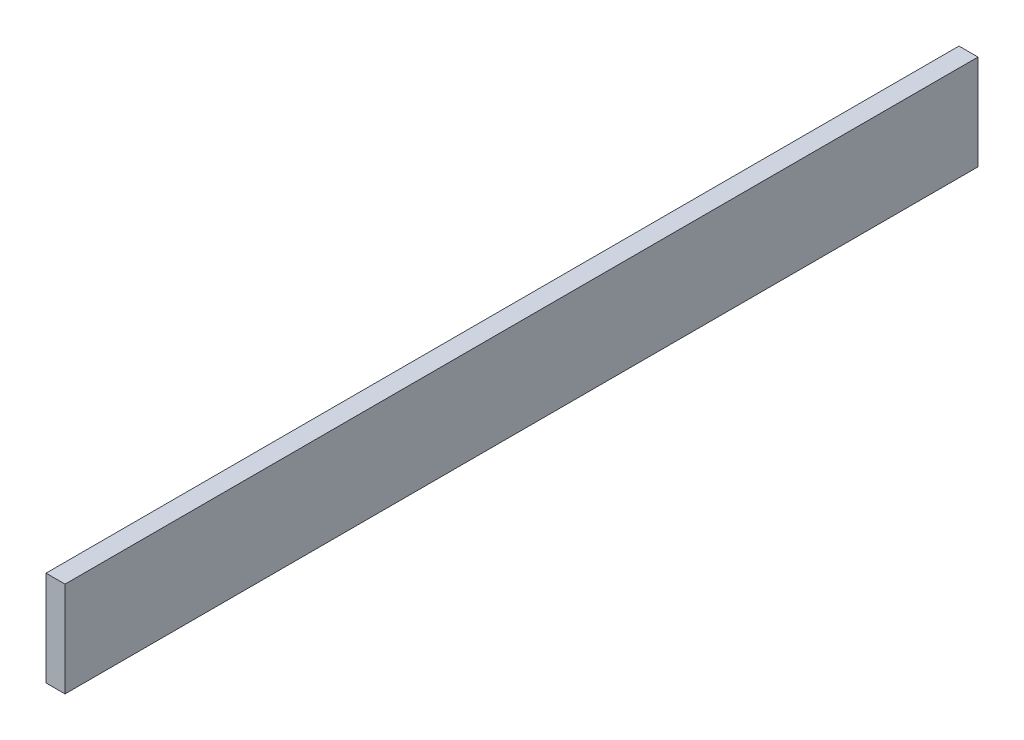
ISO-10303-21;
HEADER;
FILE_DESCRIPTION(('STEP AP214'),'2;1');
FILE_NAME('part.step','',(''),(''),'','','');
FILE_SCHEMA(('AUTOMOTIVE_DESIGN { 1 0 10303 214 1 1 1 1 }'));
ENDSEC;
DATA;
#1=APPLICATION_CONTEXT('core data for automotive mechanical design processes');
#2=APPLICATION_PROTOCOL_DEFINITION('international standard','automotive_design',2000,#1);
#3=PRODUCT_CONTEXT('',#1,'mechanical');
#4=PRODUCT('Part','Part','',(#3));
#5=PRODUCT_RELATED_PRODUCT_CATEGORY('part','',(#4));
#6=PRODUCT_DEFINITION_FORMATION('','',#4);
#7=PRODUCT_DEFINITION_CONTEXT('part definition',#1,'design');
#8=PRODUCT_DEFINITION('design','',#6,#7);
#9=PRODUCT_DEFINITION_SHAPE('','',#8);
#10=(LENGTH_UNIT() NAMED_UNIT(*) SI_UNIT(.MILLI.,.METRE.));
#11=(NAMED_UNIT(*) PLANE_ANGLE_UNIT() SI_UNIT($,.RADIAN.));
#12=(NAMED_UNIT(*) SI_UNIT($,.STERADIAN.) SOLID_ANGLE_UNIT());
#13=UNCERTAINTY_MEASURE_WITH_UNIT(LENGTH_MEASURE(1.E-05),#10,'distance_accuracy_value','');
#14=(GEOMETRIC_REPRESENTATION_CONTEXT(3) GLOBAL_UNCERTAINTY_ASSIGNED_CONTEXT((#13)) GLOBAL_UNIT_ASSIGNED_CONTEXT((#10,
#11,#12)) REPRESENTATION_CONTEXT('',''));
#15=CARTESIAN_POINT('',(0.,0.,0.));
#16=DIRECTION('',(0.,0.,1.));
#17=DIRECTION('',(1.,0.,0.));
#18=AXIS2_PLACEMENT_3D('',#15,#16,#17);
#19=CARTESIAN_POINT('',(0.,0.,-480.));
#20=DIRECTION('',(-1.,0.,0.));
#21=DIRECTION('',(0.,0.,1.));
#22=AXIS2_PLACEMENT_3D('',#19,#20,#21);
#23=PLANE('',#22);
#24=DIRECTION('',(0.,-1.,0.));
#25=VECTOR('',#24,1.);
#26=CARTESIAN_POINT('',(0.,0.,0.));
#27=LINE('',#26,#25);
#28=CARTESIAN_POINT('',(0.,50.,0.));
#29=VERTEX_POINT('',#28);
#30=CARTESIAN_POINT('',(0.,0.,0.));
#31=VERTEX_POINT('',#30);
#32=EDGE_CURVE('E96',#29,#31,#27,.T.);
#33=ORIENTED_EDGE('',*,*,#32,.F.);
#34=DIRECTION('',(0.,0.,1.));
#35=VECTOR('',#34,1.);
#36=CARTESIAN_POINT('',(0.,50.,-480.));
#37=LINE('',#36,#35);
#38=CARTESIAN_POINT('',(0.,50.,-480.));
#39=VERTEX_POINT('',#38);
#40=EDGE_CURVE('E11',#39,#29,#37,.T.);
#41=ORIENTED_EDGE('',*,*,#40,.F.);
#42=DIRECTION('',(0.,-1.,0.));
#43=VECTOR('',#42,1.);
#44=CARTESIAN_POINT('',(0.,0.,-480.));
#45=LINE('',#44,#43);
#46=CARTESIAN_POINT('',(0.,0.,-480.));
#47=VERTEX_POINT('',#46);
#48=EDGE_CURVE('E90',#39,#47,#45,.T.);
#49=ORIENTED_EDGE('',*,*,#48,.T.);
#50=DIRECTION('',(0.,0.,1.));
#51=VECTOR('',#50,1.);
#52=CARTESIAN_POINT('',(0.,0.,-480.));
#53=LINE('',#52,#51);
#54=EDGE_CURVE('E35',#47,#31,#53,.T.);
#55=ORIENTED_EDGE('',*,*,#54,.T.);
#56=EDGE_LOOP('',(#33,#41,#49,#55));
#57=FACE_BOUND('',#56,.T.);
#58=ADVANCED_FACE('F32',(#57),#23,.T.);
#59=CARTESIAN_POINT('',(0.,50.,-480.));
#60=DIRECTION('',(0.,1.,0.));
#61=DIRECTION('',(0.,0.,1.));
#62=AXIS2_PLACEMENT_3D('',#59,#60,#61);
#63=PLANE('',#62);
#64=DIRECTION('',(-1.,0.,0.));
#65=VECTOR('',#64,1.);
#66=CARTESIAN_POINT('',(0.,50.,0.));
#67=LINE('',#66,#65);
#68=CARTESIAN_POINT('',(10.,50.,0.));
#69=VERTEX_POINT('',#68);
#70=EDGE_CURVE('E92',#69,#29,#67,.T.);
#71=ORIENTED_EDGE('',*,*,#70,.F.);
#72=DIRECTION('',(0.,0.,1.));
#73=VECTOR('',#72,1.);
#74=CARTESIAN_POINT('',(10.,50.,-480.));
#75=LINE('',#74,#73);
#76=CARTESIAN_POINT('',(10.,50.,-480.));
#77=VERTEX_POINT('',#76);
#78=EDGE_CURVE('E41',#77,#69,#75,.T.);
#79=ORIENTED_EDGE('',*,*,#78,.F.);
#80=DIRECTION('',(-1.,0.,0.));
#81=VECTOR('',#80,1.);
#82=CARTESIAN_POINT('',(0.,50.,-480.));
#83=LINE('',#82,#81);
#84=EDGE_CURVE('E87',#77,#39,#83,.T.);
#85=ORIENTED_EDGE('',*,*,#84,.T.);
#86=ORIENTED_EDGE('',*,*,#40,.T.);
#87=EDGE_LOOP('',(#71,#79,#85,#86));
#88=FACE_BOUND('',#87,.T.);
#89=ADVANCED_FACE('F106',(#88),#63,.T.);
#90=CARTESIAN_POINT('',(10.,0.,-480.));
#91=DIRECTION('',(1.,0.,0.));
#92=DIRECTION('',(0.,0.,-1.));
#93=AXIS2_PLACEMENT_3D('',#90,#91,#92);
#94=PLANE('',#93);
#95=DIRECTION('',(0.,1.,0.));
#96=VECTOR('',#95,1.);
#97=CARTESIAN_POINT('',(10.,0.,0.));
#98=LINE('',#97,#96);
#99=CARTESIAN_POINT('',(10.,0.,0.));
#100=VERTEX_POINT('',#99);
#101=EDGE_CURVE('E82',#100,#69,#98,.T.);
#102=ORIENTED_EDGE('',*,*,#101,.F.);
#103=DIRECTION('',(0.,0.,1.));
#104=VECTOR('',#103,1.);
#105=CARTESIAN_POINT('',(10.,0.,-480.));
#106=LINE('',#105,#104);
#107=CARTESIAN_POINT('',(10.,0.,-480.));
#108=VERTEX_POINT('',#107);
#109=EDGE_CURVE('E77',#108,#100,#106,.T.);
#110=ORIENTED_EDGE('',*,*,#109,.F.);
#111=DIRECTION('',(0.,1.,0.));
#112=VECTOR('',#111,1.);
#113=CARTESIAN_POINT('',(10.,0.,-480.));
#114=LINE('',#113,#112);
#115=EDGE_CURVE('E80',#108,#77,#114,.T.);
#116=ORIENTED_EDGE('',*,*,#115,.T.);
#117=ORIENTED_EDGE('',*,*,#78,.T.);
#118=EDGE_LOOP('',(#102,#110,#116,#117));
#119=FACE_BOUND('',#118,.T.);
#120=ADVANCED_FACE('F79',(#119),#94,.T.);
#121=CARTESIAN_POINT('',(0.,0.,-480.));
#122=DIRECTION('',(0.,-1.,0.));
#123=DIRECTION('',(0.,0.,-1.));
#124=AXIS2_PLACEMENT_3D('',#121,#122,#123);
#125=PLANE('',#124);
#126=DIRECTION('',(1.,0.,0.));
#127=VECTOR('',#126,1.);
#128=CARTESIAN_POINT('',(0.,0.,0.));
#129=LINE('',#128,#127);
#130=EDGE_CURVE('E99',#31,#100,#129,.T.);
#131=ORIENTED_EDGE('',*,*,#130,.F.);
#132=ORIENTED_EDGE('',*,*,#54,.F.);
#133=DIRECTION('',(1.,0.,0.));
#134=VECTOR('',#133,1.);
#135=CARTESIAN_POINT('',(0.,0.,-480.));
#136=LINE('',#135,#134);
#137=EDGE_CURVE('E86',#47,#108,#136,.T.);
#138=ORIENTED_EDGE('',*,*,#137,.T.);
#139=ORIENTED_EDGE('',*,*,#109,.T.);
#140=EDGE_LOOP('',(#131,#132,#138,#139));
#141=FACE_BOUND('',#140,.T.);
#142=ADVANCED_FACE('F89',(#141),#125,.T.);
#143=CARTESIAN_POINT('',(0.,50.,-480.));
#144=DIRECTION('',(0.,0.,-1.));
#145=DIRECTION('',(-1.,0.,0.));
#146=AXIS2_PLACEMENT_3D('',#143,#144,#145);
#147=PLANE('',#146);
#148=ORIENTED_EDGE('',*,*,#48,.F.);
#149=ORIENTED_EDGE('',*,*,#84,.F.);
#150=ORIENTED_EDGE('',*,*,#115,.F.);
#151=ORIENTED_EDGE('',*,*,#137,.F.);
#152=EDGE_LOOP('',(#148,#149,#150,#151));
#153=FACE_BOUND('',#152,.T.);
#154=ADVANCED_FACE('F85',(#153),#147,.T.);
#155=CARTESIAN_POINT('',(0.,50.,0.));
#156=DIRECTION('',(0.,0.,-1.));
#157=DIRECTION('',(-1.,0.,0.));
#158=AXIS2_PLACEMENT_3D('',#155,#156,#157);
#159=PLANE('',#158);
#160=ORIENTED_EDGE('',*,*,#32,.T.);
#161=ORIENTED_EDGE('',*,*,#130,.T.);
#162=ORIENTED_EDGE('',*,*,#101,.T.);
#163=ORIENTED_EDGE('',*,*,#70,.T.);
#164=EDGE_LOOP('',(#160,#161,#162,#163));
#165=FACE_BOUND('',#164,.T.);
#166=ADVANCED_FACE('F105',(#165),#159,.F.);
#167=CLOSED_SHELL('',(#58,#89,#120,#142,#154,#166));
#168=MANIFOLD_SOLID_BREP('B2',#167);
#169=ADVANCED_BREP_SHAPE_REPRESENTATION('',(#18,#168),#14);
#170=SHAPE_DEFINITION_REPRESENTATION(#9,#169);
ENDSEC;
END-ISO-10303-21;
